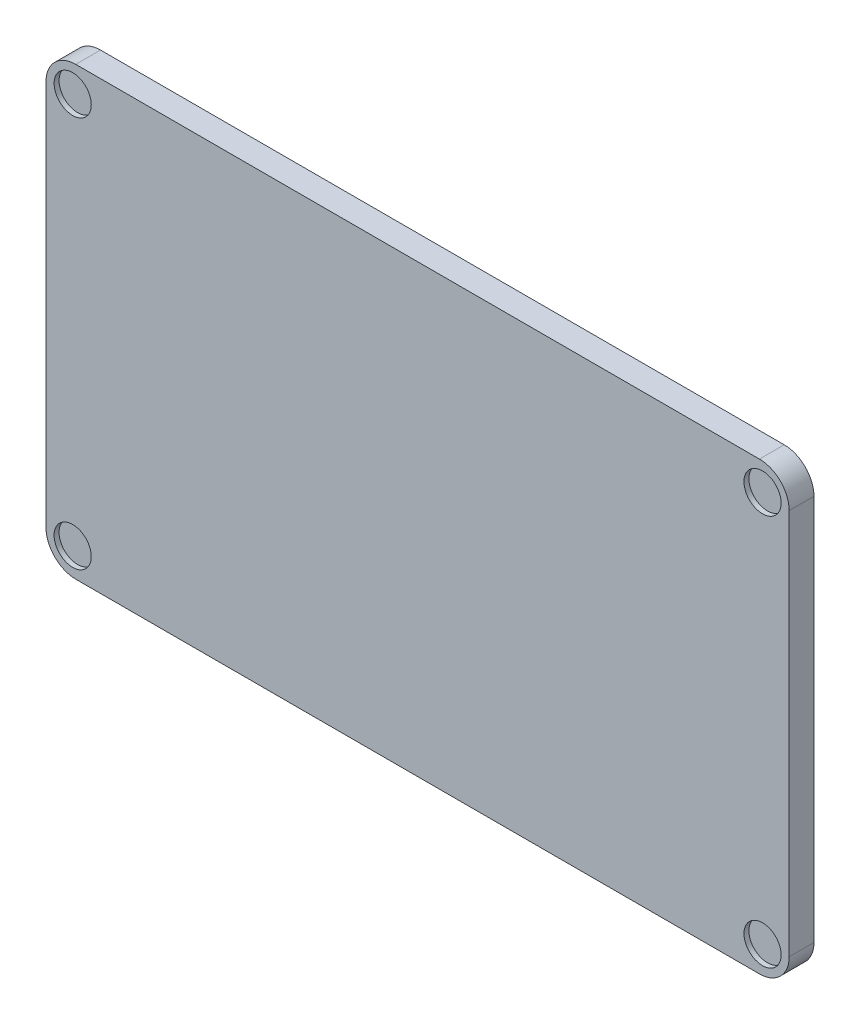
from build123d import *

# Parameters (mm, degrees)
BOSS_EXTRU_1_DEPTH      = 5
ESQUISSE3_R             = 3.75
ENL_V_MAT_EXTRU_1_DEPTH = 1


with BuildPart() as part:
    # Esquisse1 → Boss.-Extru.1 (new body)
    with BuildSketch(Plane.XY):
        with BuildLine():
            Line((69, -45), (-69, -45))
            ThreePointArc((-69, -45), (-73.242640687, -43.242640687), (-75, -39))
            Line((-75, -39), (-75, 39))
            ThreePointArc((-75, 39), (-73.242640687, 43.242640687), (-69, 45))
            Line((-69, 45), (69, 45))
            ThreePointArc((69, 45), (73.242640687, 43.242640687), (75, 39))
            Line((75, 39), (75, -39))
            ThreePointArc((75, -39), (73.242640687, -43.242640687), (69, -45))
        make_face()
    extrude(amount=BOSS_EXTRU_1_DEPTH)

    # Esquisse3 → Enl_v. mat.-Extru.1 (cut)
    with BuildSketch(Plane.XY.offset(5)):
        with Locations((-69.619605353, 39.493762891)):
            Circle(ESQUISSE3_R)
        with Locations(Location((69.619605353, 39.493762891, 0), (0, 0, 180))):
            Circle(ESQUISSE3_R)
        with Locations((69.619605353, -39.493762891)):
            Circle(ESQUISSE3_R)
        with Locations(Location((-69.619605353, -39.493762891, 0), (0, 0, 180))):
            Circle(ESQUISSE3_R)
    extrude(amount=-ENL_V_MAT_EXTRU_1_DEPTH, mode=Mode.SUBTRACT)


solid = part.part
